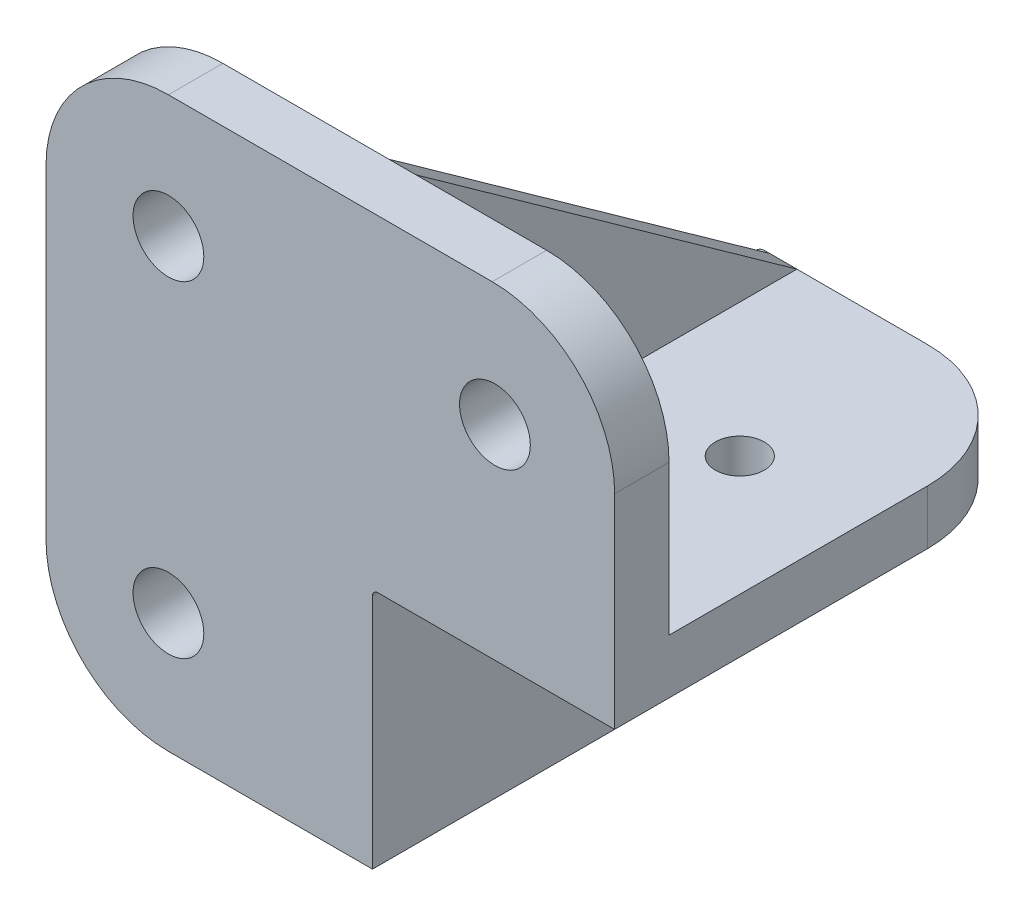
ISO-10303-21;
HEADER;
FILE_DESCRIPTION(('STEP AP214'),'2;1');
FILE_NAME('part.step','',(''),(''),'','','');
FILE_SCHEMA(('AUTOMOTIVE_DESIGN { 1 0 10303 214 1 1 1 1 }'));
ENDSEC;
DATA;
#1=APPLICATION_CONTEXT('core data for automotive mechanical design processes');
#2=APPLICATION_PROTOCOL_DEFINITION('international standard','automotive_design',2000,#1);
#3=PRODUCT_CONTEXT('',#1,'mechanical');
#4=PRODUCT('Part','Part','',(#3));
#5=PRODUCT_RELATED_PRODUCT_CATEGORY('part','',(#4));
#6=PRODUCT_DEFINITION_FORMATION('','',#4);
#7=PRODUCT_DEFINITION_CONTEXT('part definition',#1,'design');
#8=PRODUCT_DEFINITION('design','',#6,#7);
#9=PRODUCT_DEFINITION_SHAPE('','',#8);
#10=(LENGTH_UNIT() NAMED_UNIT(*) SI_UNIT(.MILLI.,.METRE.));
#11=(NAMED_UNIT(*) PLANE_ANGLE_UNIT() SI_UNIT($,.RADIAN.));
#12=(NAMED_UNIT(*) SI_UNIT($,.STERADIAN.) SOLID_ANGLE_UNIT());
#13=UNCERTAINTY_MEASURE_WITH_UNIT(LENGTH_MEASURE(1.E-05),#10,'distance_accuracy_value','');
#14=(GEOMETRIC_REPRESENTATION_CONTEXT(3) GLOBAL_UNCERTAINTY_ASSIGNED_CONTEXT((#13)) GLOBAL_UNIT_ASSIGNED_CONTEXT((#10,
#11,#12)) REPRESENTATION_CONTEXT('',''));
#15=CARTESIAN_POINT('',(0.,0.,0.));
#16=DIRECTION('',(0.,0.,1.));
#17=DIRECTION('',(1.,0.,0.));
#18=AXIS2_PLACEMENT_3D('',#15,#16,#17);
#19=CARTESIAN_POINT('',(44.5000000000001,10.0000000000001,0.));
#20=DIRECTION('',(0.,1.,0.));
#21=DIRECTION('',(0.,0.,1.));
#22=AXIS2_PLACEMENT_3D('',#19,#20,#21);
#23=PLANE('',#22);
#24=DIRECTION('',(0.,0.,-1.));
#25=VECTOR('',#24,1.);
#26=CARTESIAN_POINT('',(-7.85109886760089,10.0000000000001,0.));
#27=LINE('',#26,#25);
#28=CARTESIAN_POINT('',(-7.85109886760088,10.0000000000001,-10.));
#29=VERTEX_POINT('',#28);
#30=CARTESIAN_POINT('',(-7.85109886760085,10.0000000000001,-80.));
#31=VERTEX_POINT('',#30);
#32=EDGE_CURVE('E252',#29,#31,#27,.T.);
#33=ORIENTED_EDGE('',*,*,#32,.F.);
#34=DIRECTION('',(1.,0.,0.));
#35=VECTOR('',#34,1.);
#36=CARTESIAN_POINT('',(44.5000000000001,10.0000000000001,-10.));
#37=LINE('',#36,#35);
#38=CARTESIAN_POINT('',(-6.99999999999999,10.,-10.));
#39=VERTEX_POINT('',#38);
#40=EDGE_CURVE('E267',#29,#39,#37,.T.);
#41=ORIENTED_EDGE('',*,*,#40,.T.);
#42=DIRECTION('',(0.,0.,1.));
#43=VECTOR('',#42,1.);
#44=CARTESIAN_POINT('',(-6.99999999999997,9.99999999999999,-36.5058131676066));
#45=LINE('',#44,#43);
#46=CARTESIAN_POINT('',(-6.99999999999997,10.,-80.));
#47=VERTEX_POINT('',#46);
#48=EDGE_CURVE('E254',#47,#39,#45,.T.);
#49=ORIENTED_EDGE('',*,*,#48,.F.);
#50=DIRECTION('',(1.,0.,0.));
#51=VECTOR('',#50,1.);
#52=CARTESIAN_POINT('',(44.5000000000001,10.0000000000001,-80.));
#53=LINE('',#52,#51);
#54=EDGE_CURVE('E137',#47,#31,#53,.F.);
#55=ORIENTED_EDGE('',*,*,#54,.T.);
#56=EDGE_LOOP('',(#33,#41,#49,#55));
#57=FACE_BOUND('',#56,.T.);
#58=ADVANCED_FACE('F15',(#57),#23,.T.);
#59=CARTESIAN_POINT('',(-10.,7.85109886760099,0.));
#60=DIRECTION('',(-1.,0.,0.));
#61=DIRECTION('',(0.,0.,1.));
#62=AXIS2_PLACEMENT_3D('',#59,#60,#61);
#63=PLANE('',#62);
#64=DIRECTION('',(0.,0.,-1.));
#65=VECTOR('',#64,1.);
#66=CARTESIAN_POINT('',(-9.99999999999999,7.85109886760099,0.));
#67=LINE('',#66,#65);
#68=CARTESIAN_POINT('',(-9.99999999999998,7.85109886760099,-80.));
#69=VERTEX_POINT('',#68);
#70=CARTESIAN_POINT('',(-9.99999999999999,7.85109886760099,-10.));
#71=VERTEX_POINT('',#70);
#72=EDGE_CURVE('E249',#69,#71,#67,.F.);
#73=ORIENTED_EDGE('',*,*,#72,.F.);
#74=DIRECTION('',(0.,1.,0.));
#75=VECTOR('',#74,1.);
#76=CARTESIAN_POINT('',(-10.,7.85109886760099,-80.));
#77=LINE('',#76,#75);
#78=CARTESIAN_POINT('',(-9.99999999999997,6.99999999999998,-80.));
#79=VERTEX_POINT('',#78);
#80=EDGE_CURVE('E130',#69,#79,#77,.F.);
#81=ORIENTED_EDGE('',*,*,#80,.T.);
#82=DIRECTION('',(0.,0.,-1.));
#83=VECTOR('',#82,1.);
#84=CARTESIAN_POINT('',(-9.99999999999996,6.99999999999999,-36.5058131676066));
#85=LINE('',#84,#83);
#86=CARTESIAN_POINT('',(-9.99999999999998,6.99999999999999,-10.));
#87=VERTEX_POINT('',#86);
#88=EDGE_CURVE('E246',#79,#87,#85,.F.);
#89=ORIENTED_EDGE('',*,*,#88,.T.);
#90=DIRECTION('',(0.,1.,0.));
#91=VECTOR('',#90,1.);
#92=CARTESIAN_POINT('',(-10.,7.85109886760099,-10.));
#93=LINE('',#92,#91);
#94=EDGE_CURVE('E265',#87,#71,#93,.T.);
#95=ORIENTED_EDGE('',*,*,#94,.T.);
#96=EDGE_LOOP('',(#73,#81,#89,#95));
#97=FACE_BOUND('',#96,.T.);
#98=ADVANCED_FACE('F663',(#97),#63,.T.);
#99=CARTESIAN_POINT('',(-1.99999999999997,26.5058131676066,-36.5058131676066));
#100=DIRECTION('',(-1.,0.,0.));
#101=DIRECTION('',(0.,0.,1.));
#102=AXIS2_PLACEMENT_3D('',#99,#100,#101);
#103=PLANE('',#102);
#104=DIRECTION('',(0.,0.,1.));
#105=VECTOR('',#104,1.);
#106=CARTESIAN_POINT('',(-1.99999999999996,10.0000000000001,0.));
#107=LINE('',#106,#105);
#108=CARTESIAN_POINT('',(-1.99999999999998,10.0000000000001,-80.));
#109=VERTEX_POINT('',#108);
#110=CARTESIAN_POINT('',(-1.99999999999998,10.0000000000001,-10.));
#111=VERTEX_POINT('',#110);
#112=EDGE_CURVE('E257',#109,#111,#107,.T.);
#113=ORIENTED_EDGE('',*,*,#112,.F.);
#114=DIRECTION('',(0.,0.581238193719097,0.813733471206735));
#115=VECTOR('',#114,1.);
#116=CARTESIAN_POINT('',(-2.,9.99999999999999,-80.));
#117=LINE('',#116,#115);
#118=CARTESIAN_POINT('',(-2.,60.0000000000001,-10.));
#119=VERTEX_POINT('',#118);
#120=EDGE_CURVE('E163',#119,#109,#117,.F.);
#121=ORIENTED_EDGE('',*,*,#120,.F.);
#122=DIRECTION('',(0.,1.,0.));
#123=VECTOR('',#122,1.);
#124=CARTESIAN_POINT('',(-1.99999999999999,11.4356390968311,-10.));
#125=LINE('',#124,#123);
#126=EDGE_CURVE('E326',#111,#119,#125,.T.);
#127=ORIENTED_EDGE('',*,*,#126,.F.);
#128=EDGE_LOOP('',(#113,#121,#127));
#129=FACE_BOUND('',#128,.T.);
#130=ADVANCED_FACE('F376',(#129),#103,.F.);
#131=CARTESIAN_POINT('',(-6.99999999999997,26.5058131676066,-36.5058131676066));
#132=DIRECTION('',(-1.,0.,0.));
#133=DIRECTION('',(0.,0.,1.));
#134=AXIS2_PLACEMENT_3D('',#131,#132,#133);
#135=PLANE('',#134);
#136=DIRECTION('',(0.,1.,0.));
#137=VECTOR('',#136,1.);
#138=CARTESIAN_POINT('',(-7.,11.4356390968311,-10.));
#139=LINE('',#138,#137);
#140=CARTESIAN_POINT('',(-6.99999999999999,60.0000000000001,-10.));
#141=VERTEX_POINT('',#140);
#142=EDGE_CURVE('E322',#141,#39,#139,.F.);
#143=ORIENTED_EDGE('',*,*,#142,.F.);
#144=DIRECTION('',(0.,0.581238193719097,0.813733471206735));
#145=VECTOR('',#144,1.);
#146=CARTESIAN_POINT('',(-6.99999999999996,9.99999999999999,-80.));
#147=LINE('',#146,#145);
#148=EDGE_CURVE('E263',#47,#141,#147,.T.);
#149=ORIENTED_EDGE('',*,*,#148,.F.);
#150=ORIENTED_EDGE('',*,*,#48,.T.);
#151=EDGE_LOOP('',(#143,#149,#150));
#152=FACE_BOUND('',#151,.T.);
#153=ADVANCED_FACE('F346',(#152),#135,.T.);
#154=CARTESIAN_POINT('',(-7.85109886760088,7.85109886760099,0.));
#155=DIRECTION('',(0.,0.,-1.));
#156=DIRECTION('',(-1.,0.,0.));
#157=AXIS2_PLACEMENT_3D('',#154,#155,#156);
#158=CYLINDRICAL_SURFACE('',#157,2.14890113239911);
#159=CARTESIAN_POINT('',(-7.85109886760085,7.85109886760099,-80.));
#160=DIRECTION('',(0.,0.,-1.));
#161=DIRECTION('',(-1.,0.,0.));
#162=AXIS2_PLACEMENT_3D('',#159,#160,#161);
#163=CIRCLE('',#162,2.14890113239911);
#164=EDGE_CURVE('E18',#69,#31,#163,.T.);
#165=ORIENTED_EDGE('',*,*,#164,.F.);
#166=ORIENTED_EDGE('',*,*,#72,.T.);
#167=CARTESIAN_POINT('',(-7.85109886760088,7.85109886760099,-10.));
#168=DIRECTION('',(0.,0.,-1.));
#169=DIRECTION('',(-1.,0.,0.));
#170=AXIS2_PLACEMENT_3D('',#167,#168,#169);
#171=CIRCLE('',#170,2.14890113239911);
#172=EDGE_CURVE('E222',#29,#71,#171,.F.);
#173=ORIENTED_EDGE('',*,*,#172,.F.);
#174=ORIENTED_EDGE('',*,*,#32,.T.);
#175=EDGE_LOOP('',(#165,#166,#173,#174));
#176=FACE_BOUND('',#175,.T.);
#177=ADVANCED_FACE('F340',(#176),#158,.T.);
#178=CARTESIAN_POINT('',(-26.5058131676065,6.99999999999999,-36.5058131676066));
#179=DIRECTION('',(0.,-1.,0.));
#180=DIRECTION('',(0.,0.,-1.));
#181=AXIS2_PLACEMENT_3D('',#178,#179,#180);
#182=PLANE('',#181);
#183=ORIENTED_EDGE('',*,*,#88,.F.);
#184=DIRECTION('',(-0.581238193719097,0.,0.813733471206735));
#185=VECTOR('',#184,1.);
#186=CARTESIAN_POINT('',(-9.99999999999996,6.99999999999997,-80.));
#187=LINE('',#186,#185);
#188=CARTESIAN_POINT('',(-59.9999999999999,6.99999999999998,-10.));
#189=VERTEX_POINT('',#188);
#190=EDGE_CURVE('E190',#189,#79,#187,.F.);
#191=ORIENTED_EDGE('',*,*,#190,.F.);
#192=DIRECTION('',(-1.,0.,0.));
#193=VECTOR('',#192,1.);
#194=CARTESIAN_POINT('',(-11.4356390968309,6.99999999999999,-10.));
#195=LINE('',#194,#193);
#196=EDGE_CURVE('E175',#87,#189,#195,.T.);
#197=ORIENTED_EDGE('',*,*,#196,.F.);
#198=EDGE_LOOP('',(#183,#191,#197));
#199=FACE_BOUND('',#198,.T.);
#200=ADVANCED_FACE('F637',(#199),#182,.F.);
#201=CARTESIAN_POINT('',(-26.5058131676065,1.99999999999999,-36.5058131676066));
#202=DIRECTION('',(0.,-1.,0.));
#203=DIRECTION('',(0.,0.,-1.));
#204=AXIS2_PLACEMENT_3D('',#201,#202,#203);
#205=PLANE('',#204);
#206=DIRECTION('',(-1.,0.,0.));
#207=VECTOR('',#206,1.);
#208=CARTESIAN_POINT('',(-11.4356390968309,1.99999999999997,-10.));
#209=LINE('',#208,#207);
#210=CARTESIAN_POINT('',(-59.9999999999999,1.99999999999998,-10.));
#211=VERTEX_POINT('',#210);
#212=CARTESIAN_POINT('',(-9.99999999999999,1.99999999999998,-10.));
#213=VERTEX_POINT('',#212);
#214=EDGE_CURVE('E203',#211,#213,#209,.F.);
#215=ORIENTED_EDGE('',*,*,#214,.F.);
#216=DIRECTION('',(-0.581238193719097,0.,0.813733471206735));
#217=VECTOR('',#216,1.);
#218=CARTESIAN_POINT('',(-9.99999999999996,1.99999999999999,-80.));
#219=LINE('',#218,#217);
#220=CARTESIAN_POINT('',(-9.99999999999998,1.99999999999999,-80.));
#221=VERTEX_POINT('',#220);
#222=EDGE_CURVE('E181',#221,#211,#219,.T.);
#223=ORIENTED_EDGE('',*,*,#222,.F.);
#224=DIRECTION('',(0.,0.,1.));
#225=VECTOR('',#224,1.);
#226=CARTESIAN_POINT('',(-10.,1.99999999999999,0.));
#227=LINE('',#226,#225);
#228=EDGE_CURVE('E144',#213,#221,#227,.F.);
#229=ORIENTED_EDGE('',*,*,#228,.F.);
#230=EDGE_LOOP('',(#215,#223,#229));
#231=FACE_BOUND('',#230,.T.);
#232=ADVANCED_FACE('F204',(#231),#205,.T.);
#233=CARTESIAN_POINT('',(22.5,4.99999999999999,-45.));
#234=DIRECTION('',(0.,1.,0.));
#235=DIRECTION('',(-1.,0.,0.));
#236=AXIS2_PLACEMENT_3D('',#233,#234,#235);
#237=CYLINDRICAL_SURFACE('',#236,4.5);
#238=CARTESIAN_POINT('',(22.5,0.,-45.));
#239=DIRECTION('',(0.,1.,0.));
#240=DIRECTION('',(-1.,0.,0.));
#241=AXIS2_PLACEMENT_3D('',#238,#239,#240);
#242=CIRCLE('',#241,4.5);
#243=CARTESIAN_POINT('',(18.,0.,-45.));
#244=VERTEX_POINT('',#243);
#245=EDGE_CURVE('E314',#244,#244,#242,.T.);
#246=ORIENTED_EDGE('',*,*,#245,.F.);
#247=EDGE_LOOP('',(#246));
#248=FACE_BOUND('',#247,.T.);
#249=CARTESIAN_POINT('',(22.5,10.0000000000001,-45.));
#250=DIRECTION('',(0.,1.,0.));
#251=DIRECTION('',(-1.,0.,0.));
#252=AXIS2_PLACEMENT_3D('',#249,#250,#251);
#253=CIRCLE('',#252,4.5);
#254=CARTESIAN_POINT('',(18.,10.0000000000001,-45.));
#255=VERTEX_POINT('',#254);
#256=EDGE_CURVE('E323',#255,#255,#253,.F.);
#257=ORIENTED_EDGE('',*,*,#256,.F.);
#258=EDGE_LOOP('',(#257));
#259=FACE_BOUND('',#258,.T.);
#260=ADVANCED_FACE('F623',(#248,#259),#237,.F.);
#261=CARTESIAN_POINT('',(8.26219036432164,-8.26219036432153,-80.));
#262=DIRECTION('',(0.,0.,-1.));
#263=DIRECTION('',(-1.,0.,0.));
#264=AXIS2_PLACEMENT_3D('',#261,#262,#263);
#265=PLANE('',#264);
#266=DIRECTION('',(1.,0.,0.));
#267=VECTOR('',#266,1.);
#268=CARTESIAN_POINT('',(-1.99999999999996,9.99999999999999,-80.));
#269=LINE('',#268,#267);
#270=EDGE_CURVE('E244',#109,#47,#269,.F.);
#271=ORIENTED_EDGE('',*,*,#270,.F.);
#272=DIRECTION('',(1.,0.,0.));
#273=VECTOR('',#272,1.);
#274=CARTESIAN_POINT('',(44.5000000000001,10.0000000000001,-80.));
#275=LINE('',#274,#273);
#276=CARTESIAN_POINT('',(22.,10.0000000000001,-80.));
#277=VERTEX_POINT('',#276);
#278=EDGE_CURVE('E243',#277,#109,#275,.F.);
#279=ORIENTED_EDGE('',*,*,#278,.F.);
#280=DIRECTION('',(0.,-1.,0.));
#281=VECTOR('',#280,1.);
#282=CARTESIAN_POINT('',(22.,12.5,-80.));
#283=LINE('',#282,#281);
#284=CARTESIAN_POINT('',(22.,0.,-80.));
#285=VERTEX_POINT('',#284);
#286=EDGE_CURVE('E241',#285,#277,#283,.F.);
#287=ORIENTED_EDGE('',*,*,#286,.F.);
#288=DIRECTION('',(1.,0.,0.));
#289=VECTOR('',#288,1.);
#290=CARTESIAN_POINT('',(1.,0.,-80.));
#291=LINE('',#290,#289);
#292=CARTESIAN_POINT('',(1.00000000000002,0.,-80.));
#293=VERTEX_POINT('',#292);
#294=EDGE_CURVE('E317',#293,#285,#291,.T.);
#295=ORIENTED_EDGE('',*,*,#294,.F.);
#296=CARTESIAN_POINT('',(1.00000000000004,-1.00000000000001,-80.));
#297=DIRECTION('',(0.,0.,-1.));
#298=DIRECTION('',(-1.,0.,0.));
#299=AXIS2_PLACEMENT_3D('',#296,#297,#298);
#300=CIRCLE('',#299,1.);
#301=CARTESIAN_POINT('',(0.,-1.00000000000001,-80.));
#302=VERTEX_POINT('',#301);
#303=EDGE_CURVE('E332',#293,#302,#300,.F.);
#304=ORIENTED_EDGE('',*,*,#303,.T.);
#305=DIRECTION('',(0.,1.,0.));
#306=VECTOR('',#305,1.);
#307=CARTESIAN_POINT('',(0.,-44.5000000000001,-80.));
#308=LINE('',#307,#306);
#309=CARTESIAN_POINT('',(0.,-22.,-80.));
#310=VERTEX_POINT('',#309);
#311=EDGE_CURVE('E313',#310,#302,#308,.T.);
#312=ORIENTED_EDGE('',*,*,#311,.F.);
#313=DIRECTION('',(-1.,0.,0.));
#314=VECTOR('',#313,1.);
#315=CARTESIAN_POINT('',(2.50000000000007,-22.,-80.));
#316=LINE('',#315,#314);
#317=CARTESIAN_POINT('',(-9.99999999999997,-22.,-80.));
#318=VERTEX_POINT('',#317);
#319=EDGE_CURVE('E238',#318,#310,#316,.F.);
#320=ORIENTED_EDGE('',*,*,#319,.F.);
#321=DIRECTION('',(0.,1.,0.));
#322=VECTOR('',#321,1.);
#323=CARTESIAN_POINT('',(-10.,7.85109886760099,-80.));
#324=LINE('',#323,#322);
#325=EDGE_CURVE('E228',#221,#318,#324,.F.);
#326=ORIENTED_EDGE('',*,*,#325,.F.);
#327=DIRECTION('',(0.,1.,0.));
#328=VECTOR('',#327,1.);
#329=CARTESIAN_POINT('',(-9.99999999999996,6.99999999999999,-80.));
#330=LINE('',#329,#328);
#331=EDGE_CURVE('E186',#79,#221,#330,.F.);
#332=ORIENTED_EDGE('',*,*,#331,.F.);
#333=ORIENTED_EDGE('',*,*,#80,.F.);
#334=ORIENTED_EDGE('',*,*,#164,.T.);
#335=ORIENTED_EDGE('',*,*,#54,.F.);
#336=EDGE_LOOP('',(#271,#279,#287,#295,#304,#312,#320,#326,#332,#333,#334,#335));
#337=FACE_BOUND('',#336,.T.);
#338=ADVANCED_FACE('F338',(#337),#265,.T.);
#339=CARTESIAN_POINT('',(1.,-1.,0.));
#340=DIRECTION('',(0.,0.,-1.));
#341=DIRECTION('',(-1.,0.,0.));
#342=AXIS2_PLACEMENT_3D('',#339,#340,#341);
#343=CYLINDRICAL_SURFACE('',#342,1.);
#344=CARTESIAN_POINT('',(1.,-1.,0.));
#345=DIRECTION('',(0.,0.,-1.));
#346=DIRECTION('',(-1.,0.,0.));
#347=AXIS2_PLACEMENT_3D('',#344,#345,#346);
#348=CIRCLE('',#347,1.);
#349=CARTESIAN_POINT('',(0.,-1.00000000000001,0.));
#350=VERTEX_POINT('',#349);
#351=CARTESIAN_POINT('',(1.,0.,0.));
#352=VERTEX_POINT('',#351);
#353=EDGE_CURVE('E240',#350,#352,#348,.T.);
#354=ORIENTED_EDGE('',*,*,#353,.F.);
#355=DIRECTION('',(0.,0.,-1.));
#356=VECTOR('',#355,1.);
#357=CARTESIAN_POINT('',(0.,-1.00000000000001,0.));
#358=LINE('',#357,#356);
#359=EDGE_CURVE('E309',#302,#350,#358,.F.);
#360=ORIENTED_EDGE('',*,*,#359,.F.);
#361=ORIENTED_EDGE('',*,*,#303,.F.);
#362=DIRECTION('',(0.,0.,-1.));
#363=VECTOR('',#362,1.);
#364=CARTESIAN_POINT('',(1.,0.,0.));
#365=LINE('',#364,#363);
#366=EDGE_CURVE('E319',#352,#293,#365,.T.);
#367=ORIENTED_EDGE('',*,*,#366,.F.);
#368=EDGE_LOOP('',(#354,#360,#361,#367));
#369=FACE_BOUND('',#368,.T.);
#370=ADVANCED_FACE('F608',(#369),#343,.F.);
#371=CARTESIAN_POINT('',(-4.99999999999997,-22.5,-45.));
#372=DIRECTION('',(-1.,0.,0.));
#373=DIRECTION('',(0.,0.,1.));
#374=AXIS2_PLACEMENT_3D('',#371,#372,#373);
#375=CYLINDRICAL_SURFACE('',#374,4.5);
#376=CARTESIAN_POINT('',(-9.99999999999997,-22.5,-45.));
#377=DIRECTION('',(-1.,0.,0.));
#378=DIRECTION('',(0.,0.,1.));
#379=AXIS2_PLACEMENT_3D('',#376,#377,#378);
#380=CIRCLE('',#379,4.5);
#381=CARTESIAN_POINT('',(-9.99999999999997,-22.5,-40.5));
#382=VERTEX_POINT('',#381);
#383=EDGE_CURVE('E191',#382,#382,#380,.F.);
#384=ORIENTED_EDGE('',*,*,#383,.F.);
#385=EDGE_LOOP('',(#384));
#386=FACE_BOUND('',#385,.T.);
#387=CARTESIAN_POINT('',(0.,-22.5,-45.));
#388=DIRECTION('',(-1.,0.,0.));
#389=DIRECTION('',(0.,0.,1.));
#390=AXIS2_PLACEMENT_3D('',#387,#388,#389);
#391=CIRCLE('',#390,4.5);
#392=CARTESIAN_POINT('',(0.,-22.5,-40.5));
#393=VERTEX_POINT('',#392);
#394=EDGE_CURVE('E233',#393,#393,#391,.T.);
#395=ORIENTED_EDGE('',*,*,#394,.F.);
#396=EDGE_LOOP('',(#395));
#397=FACE_BOUND('',#396,.T.);
#398=ADVANCED_FACE('F600',(#386,#397),#375,.F.);
#399=CARTESIAN_POINT('',(2.50000000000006,-22.,-57.5));
#400=DIRECTION('',(-1.,0.,0.));
#401=DIRECTION('',(0.,0.,1.));
#402=AXIS2_PLACEMENT_3D('',#399,#400,#401);
#403=CYLINDRICAL_SURFACE('',#402,22.5);
#404=CARTESIAN_POINT('',(0.,-22.,-57.5));
#405=DIRECTION('',(-1.,0.,0.));
#406=DIRECTION('',(0.,0.,1.));
#407=AXIS2_PLACEMENT_3D('',#404,#405,#406);
#408=CIRCLE('',#407,22.5);
#409=CARTESIAN_POINT('',(0.,-44.5000000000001,-57.5));
#410=VERTEX_POINT('',#409);
#411=EDGE_CURVE('E310',#410,#310,#408,.F.);
#412=ORIENTED_EDGE('',*,*,#411,.F.);
#413=DIRECTION('',(1.,0.,0.));
#414=VECTOR('',#413,1.);
#415=CARTESIAN_POINT('',(-37.4999999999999,-44.5000000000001,-57.5));
#416=LINE('',#415,#414);
#417=CARTESIAN_POINT('',(-9.99999999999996,-44.5000000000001,-57.5));
#418=VERTEX_POINT('',#417);
#419=EDGE_CURVE('E231',#418,#410,#416,.T.);
#420=ORIENTED_EDGE('',*,*,#419,.F.);
#421=CARTESIAN_POINT('',(-9.99999999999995,-22.,-57.5));
#422=DIRECTION('',(-1.,0.,0.));
#423=DIRECTION('',(0.,0.,1.));
#424=AXIS2_PLACEMENT_3D('',#421,#422,#423);
#425=CIRCLE('',#424,22.5);
#426=EDGE_CURVE('E230',#318,#418,#425,.T.);
#427=ORIENTED_EDGE('',*,*,#426,.F.);
#428=ORIENTED_EDGE('',*,*,#319,.T.);
#429=EDGE_LOOP('',(#412,#420,#427,#428));
#430=FACE_BOUND('',#429,.T.);
#431=ADVANCED_FACE('F592',(#430),#403,.T.);
#432=CARTESIAN_POINT('',(-10.,7.85109886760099,0.));
#433=DIRECTION('',(-1.,0.,0.));
#434=DIRECTION('',(0.,0.,1.));
#435=AXIS2_PLACEMENT_3D('',#432,#433,#434);
#436=PLANE('',#435);
#437=ORIENTED_EDGE('',*,*,#383,.T.);
#438=EDGE_LOOP('',(#437));
#439=FACE_BOUND('',#438,.T.);
#440=ORIENTED_EDGE('',*,*,#325,.T.);
#441=ORIENTED_EDGE('',*,*,#426,.T.);
#442=DIRECTION('',(0.,0.,-1.));
#443=VECTOR('',#442,1.);
#444=CARTESIAN_POINT('',(-9.99999999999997,-44.5000000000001,0.));
#445=LINE('',#444,#443);
#446=CARTESIAN_POINT('',(-9.99999999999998,-44.5000000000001,-10.));
#447=VERTEX_POINT('',#446);
#448=EDGE_CURVE('E226',#447,#418,#445,.T.);
#449=ORIENTED_EDGE('',*,*,#448,.F.);
#450=DIRECTION('',(0.,1.,0.));
#451=VECTOR('',#450,1.);
#452=CARTESIAN_POINT('',(-9.99999999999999,11.4356390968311,-10.));
#453=LINE('',#452,#451);
#454=EDGE_CURVE('E207',#213,#447,#453,.F.);
#455=ORIENTED_EDGE('',*,*,#454,.F.);
#456=ORIENTED_EDGE('',*,*,#228,.T.);
#457=EDGE_LOOP('',(#440,#441,#449,#455,#456));
#458=FACE_BOUND('',#457,.T.);
#459=ADVANCED_FACE('F585',(#439,#458),#436,.T.);
#460=CARTESIAN_POINT('',(-9.99999999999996,6.99999999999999,-80.));
#461=DIRECTION('',(-0.813733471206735,0.,-0.581238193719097));
#462=DIRECTION('',(-0.581238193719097,0.,0.813733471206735));
#463=AXIS2_PLACEMENT_3D('',#460,#461,#462);
#464=PLANE('',#463);
#465=ORIENTED_EDGE('',*,*,#190,.T.);
#466=ORIENTED_EDGE('',*,*,#331,.T.);
#467=ORIENTED_EDGE('',*,*,#222,.T.);
#468=DIRECTION('',(0.,1.,0.));
#469=VECTOR('',#468,1.);
#470=CARTESIAN_POINT('',(-59.9999999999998,37.5,-10.));
#471=LINE('',#470,#469);
#472=EDGE_CURVE('E185',#189,#211,#471,.F.);
#473=ORIENTED_EDGE('',*,*,#472,.F.);
#474=EDGE_LOOP('',(#465,#466,#467,#473));
#475=FACE_BOUND('',#474,.T.);
#476=ADVANCED_FACE('F184',(#475),#464,.T.);
#477=CARTESIAN_POINT('',(-1.99999999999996,9.99999999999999,-80.));
#478=DIRECTION('',(0.,0.813733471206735,-0.581238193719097));
#479=DIRECTION('',(0.,0.581238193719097,0.813733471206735));
#480=AXIS2_PLACEMENT_3D('',#477,#478,#479);
#481=PLANE('',#480);
#482=ORIENTED_EDGE('',*,*,#120,.T.);
#483=ORIENTED_EDGE('',*,*,#270,.T.);
#484=ORIENTED_EDGE('',*,*,#148,.T.);
#485=DIRECTION('',(1.,0.,0.));
#486=VECTOR('',#485,1.);
#487=CARTESIAN_POINT('',(22.0000000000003,60.0000000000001,-10.));
#488=LINE('',#487,#486);
#489=EDGE_CURVE('E358',#119,#141,#488,.F.);
#490=ORIENTED_EDGE('',*,*,#489,.F.);
#491=EDGE_LOOP('',(#482,#483,#484,#490));
#492=FACE_BOUND('',#491,.T.);
#493=ADVANCED_FACE('F378',(#492),#481,.T.);
#494=CARTESIAN_POINT('',(22.,12.5,-57.5));
#495=DIRECTION('',(0.,-1.,0.));
#496=DIRECTION('',(1.,0.,0.));
#497=AXIS2_PLACEMENT_3D('',#494,#495,#496);
#498=CYLINDRICAL_SURFACE('',#497,22.5);
#499=CARTESIAN_POINT('',(22.,10.0000000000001,-57.5));
#500=DIRECTION('',(0.,-1.,0.));
#501=DIRECTION('',(1.,0.,0.));
#502=AXIS2_PLACEMENT_3D('',#499,#500,#501);
#503=CIRCLE('',#502,22.5);
#504=CARTESIAN_POINT('',(44.5000000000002,10.0000000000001,-57.5));
#505=VERTEX_POINT('',#504);
#506=EDGE_CURVE('E260',#505,#277,#503,.F.);
#507=ORIENTED_EDGE('',*,*,#506,.F.);
#508=DIRECTION('',(0.,1.,0.));
#509=VECTOR('',#508,1.);
#510=CARTESIAN_POINT('',(44.5000000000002,0.,-57.5));
#511=LINE('',#510,#509);
#512=CARTESIAN_POINT('',(44.5000000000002,0.,-57.5));
#513=VERTEX_POINT('',#512);
#514=EDGE_CURVE('E387',#513,#505,#511,.T.);
#515=ORIENTED_EDGE('',*,*,#514,.F.);
#516=CARTESIAN_POINT('',(22.,0.,-57.5));
#517=DIRECTION('',(0.,-1.,0.));
#518=DIRECTION('',(1.,0.,0.));
#519=AXIS2_PLACEMENT_3D('',#516,#517,#518);
#520=CIRCLE('',#519,22.5);
#521=EDGE_CURVE('E237',#285,#513,#520,.T.);
#522=ORIENTED_EDGE('',*,*,#521,.F.);
#523=ORIENTED_EDGE('',*,*,#286,.T.);
#524=EDGE_LOOP('',(#507,#515,#522,#523));
#525=FACE_BOUND('',#524,.T.);
#526=ADVANCED_FACE('F430',(#525),#498,.T.);
#527=CARTESIAN_POINT('',(44.5000000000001,10.0000000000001,0.));
#528=DIRECTION('',(0.,1.,0.));
#529=DIRECTION('',(0.,0.,1.));
#530=AXIS2_PLACEMENT_3D('',#527,#528,#529);
#531=PLANE('',#530);
#532=ORIENTED_EDGE('',*,*,#256,.T.);
#533=EDGE_LOOP('',(#532));
#534=FACE_BOUND('',#533,.T.);
#535=DIRECTION('',(0.,0.,-1.));
#536=VECTOR('',#535,1.);
#537=CARTESIAN_POINT('',(44.5000000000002,10.0000000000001,0.));
#538=LINE('',#537,#536);
#539=CARTESIAN_POINT('',(44.5000000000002,10.0000000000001,-9.99999999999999));
#540=VERTEX_POINT('',#539);
#541=EDGE_CURVE('E384',#505,#540,#538,.F.);
#542=ORIENTED_EDGE('',*,*,#541,.F.);
#543=ORIENTED_EDGE('',*,*,#506,.T.);
#544=ORIENTED_EDGE('',*,*,#278,.T.);
#545=ORIENTED_EDGE('',*,*,#112,.T.);
#546=DIRECTION('',(-1.,0.,0.));
#547=VECTOR('',#546,1.);
#548=CARTESIAN_POINT('',(-11.4356390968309,10.0000000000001,-10.));
#549=LINE('',#548,#547);
#550=EDGE_CURVE('E351',#540,#111,#549,.T.);
#551=ORIENTED_EDGE('',*,*,#550,.F.);
#552=EDGE_LOOP('',(#542,#543,#544,#545,#551));
#553=FACE_BOUND('',#552,.T.);
#554=ADVANCED_FACE('F428',(#534,#553),#531,.T.);
#555=CARTESIAN_POINT('',(-11.4356390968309,11.4356390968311,-10.));
#556=DIRECTION('',(0.,0.,-1.));
#557=DIRECTION('',(-1.,0.,0.));
#558=AXIS2_PLACEMENT_3D('',#555,#556,#557);
#559=PLANE('',#558);
#560=CARTESIAN_POINT('',(22.5,37.5,-10.));
#561=DIRECTION('',(0.,0.,1.));
#562=DIRECTION('',(1.,0.,0.));
#563=AXIS2_PLACEMENT_3D('',#560,#561,#562);
#564=CIRCLE('',#563,6.5);
#565=CARTESIAN_POINT('',(29.,37.5,-9.99999999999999));
#566=VERTEX_POINT('',#565);
#567=EDGE_CURVE('E295',#566,#566,#564,.T.);
#568=ORIENTED_EDGE('',*,*,#567,.T.);
#569=EDGE_LOOP('',(#568));
#570=FACE_BOUND('',#569,.T.);
#571=DIRECTION('',(0.,1.,0.));
#572=VECTOR('',#571,1.);
#573=CARTESIAN_POINT('',(44.5000000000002,0.,-9.99999999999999));
#574=LINE('',#573,#572);
#575=CARTESIAN_POINT('',(44.5000000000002,37.5000000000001,-9.99999999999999));
#576=VERTEX_POINT('',#575);
#577=EDGE_CURVE('E386',#540,#576,#574,.T.);
#578=ORIENTED_EDGE('',*,*,#577,.F.);
#579=ORIENTED_EDGE('',*,*,#550,.T.);
#580=ORIENTED_EDGE('',*,*,#126,.T.);
#581=DIRECTION('',(1.,0.,0.));
#582=VECTOR('',#581,1.);
#583=CARTESIAN_POINT('',(22.0000000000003,60.0000000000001,-10.));
#584=LINE('',#583,#582);
#585=CARTESIAN_POINT('',(22.0000000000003,60.0000000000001,-10.));
#586=VERTEX_POINT('',#585);
#587=EDGE_CURVE('E361',#586,#119,#584,.F.);
#588=ORIENTED_EDGE('',*,*,#587,.F.);
#589=CARTESIAN_POINT('',(22.0000000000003,37.5000000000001,-10.));
#590=DIRECTION('',(0.,0.,-1.));
#591=DIRECTION('',(-1.,0.,0.));
#592=AXIS2_PLACEMENT_3D('',#589,#590,#591);
#593=CIRCLE('',#592,22.5);
#594=EDGE_CURVE('E299',#576,#586,#593,.F.);
#595=ORIENTED_EDGE('',*,*,#594,.F.);
#596=EDGE_LOOP('',(#578,#579,#580,#588,#595));
#597=FACE_BOUND('',#596,.T.);
#598=ADVANCED_FACE('F368',(#570,#597),#559,.T.);
#599=CARTESIAN_POINT('',(-11.4356390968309,11.4356390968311,-10.));
#600=DIRECTION('',(0.,0.,-1.));
#601=DIRECTION('',(-1.,0.,0.));
#602=AXIS2_PLACEMENT_3D('',#599,#600,#601);
#603=PLANE('',#602);
#604=CARTESIAN_POINT('',(-37.5,37.5,-10.));
#605=DIRECTION('',(0.,0.,1.));
#606=DIRECTION('',(1.,0.,0.));
#607=AXIS2_PLACEMENT_3D('',#604,#605,#606);
#608=CIRCLE('',#607,6.5);
#609=CARTESIAN_POINT('',(-31.,37.5,-10.));
#610=VERTEX_POINT('',#609);
#611=EDGE_CURVE('E292',#610,#610,#608,.T.);
#612=ORIENTED_EDGE('',*,*,#611,.T.);
#613=EDGE_LOOP('',(#612));
#614=FACE_BOUND('',#613,.T.);
#615=CARTESIAN_POINT('',(-37.4999999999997,37.5,-10.));
#616=DIRECTION('',(0.,0.,-1.));
#617=DIRECTION('',(-1.,0.,0.));
#618=AXIS2_PLACEMENT_3D('',#615,#616,#617);
#619=CIRCLE('',#618,22.5000000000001);
#620=CARTESIAN_POINT('',(-37.4999999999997,60.0000000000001,-10.));
#621=VERTEX_POINT('',#620);
#622=CARTESIAN_POINT('',(-59.9999999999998,37.5,-10.));
#623=VERTEX_POINT('',#622);
#624=EDGE_CURVE('E215',#621,#623,#619,.F.);
#625=ORIENTED_EDGE('',*,*,#624,.F.);
#626=DIRECTION('',(1.,0.,0.));
#627=VECTOR('',#626,1.);
#628=CARTESIAN_POINT('',(22.0000000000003,60.0000000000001,-10.));
#629=LINE('',#628,#627);
#630=EDGE_CURVE('E350',#141,#621,#629,.F.);
#631=ORIENTED_EDGE('',*,*,#630,.F.);
#632=ORIENTED_EDGE('',*,*,#142,.T.);
#633=ORIENTED_EDGE('',*,*,#40,.F.);
#634=ORIENTED_EDGE('',*,*,#172,.T.);
#635=ORIENTED_EDGE('',*,*,#94,.F.);
#636=ORIENTED_EDGE('',*,*,#196,.T.);
#637=DIRECTION('',(0.,1.,0.));
#638=VECTOR('',#637,1.);
#639=CARTESIAN_POINT('',(-59.9999999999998,37.5,-10.));
#640=LINE('',#639,#638);
#641=EDGE_CURVE('E200',#623,#189,#640,.F.);
#642=ORIENTED_EDGE('',*,*,#641,.F.);
#643=EDGE_LOOP('',(#625,#631,#632,#633,#634,#635,#636,#642));
#644=FACE_BOUND('',#643,.T.);
#645=ADVANCED_FACE('F349',(#614,#644),#603,.T.);
#646=CARTESIAN_POINT('',(-11.4356390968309,11.4356390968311,-10.));
#647=DIRECTION('',(0.,0.,-1.));
#648=DIRECTION('',(-1.,0.,0.));
#649=AXIS2_PLACEMENT_3D('',#646,#647,#648);
#650=PLANE('',#649);
#651=CARTESIAN_POINT('',(-37.5,-22.5,-10.));
#652=DIRECTION('',(0.,0.,1.));
#653=DIRECTION('',(1.,0.,0.));
#654=AXIS2_PLACEMENT_3D('',#651,#652,#653);
#655=CIRCLE('',#654,6.5);
#656=CARTESIAN_POINT('',(-31.,-22.5,-10.));
#657=VERTEX_POINT('',#656);
#658=EDGE_CURVE('E288',#657,#657,#655,.T.);
#659=ORIENTED_EDGE('',*,*,#658,.T.);
#660=EDGE_LOOP('',(#659));
#661=FACE_BOUND('',#660,.T.);
#662=CARTESIAN_POINT('',(-37.4999999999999,-22.0000000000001,-10.));
#663=DIRECTION('',(0.,0.,-1.));
#664=DIRECTION('',(-1.,0.,0.));
#665=AXIS2_PLACEMENT_3D('',#662,#663,#664);
#666=CIRCLE('',#665,22.5);
#667=CARTESIAN_POINT('',(-59.9999999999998,-22.0000000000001,-10.));
#668=VERTEX_POINT('',#667);
#669=CARTESIAN_POINT('',(-37.4999999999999,-44.5000000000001,-10.));
#670=VERTEX_POINT('',#669);
#671=EDGE_CURVE('E211',#668,#670,#666,.F.);
#672=ORIENTED_EDGE('',*,*,#671,.F.);
#673=DIRECTION('',(0.,1.,0.));
#674=VECTOR('',#673,1.);
#675=CARTESIAN_POINT('',(-59.9999999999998,37.5,-10.));
#676=LINE('',#675,#674);
#677=EDGE_CURVE('E197',#211,#668,#676,.F.);
#678=ORIENTED_EDGE('',*,*,#677,.F.);
#679=ORIENTED_EDGE('',*,*,#214,.T.);
#680=ORIENTED_EDGE('',*,*,#454,.T.);
#681=DIRECTION('',(1.,0.,0.));
#682=VECTOR('',#681,1.);
#683=CARTESIAN_POINT('',(-37.4999999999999,-44.5000000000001,-10.));
#684=LINE('',#683,#682);
#685=EDGE_CURVE('E223',#670,#447,#684,.T.);
#686=ORIENTED_EDGE('',*,*,#685,.F.);
#687=EDGE_LOOP('',(#672,#678,#679,#680,#686));
#688=FACE_BOUND('',#687,.T.);
#689=ADVANCED_FACE('F209',(#661,#688),#650,.T.);
#690=CARTESIAN_POINT('',(1.,0.,0.));
#691=DIRECTION('',(0.,-1.,0.));
#692=DIRECTION('',(0.,0.,-1.));
#693=AXIS2_PLACEMENT_3D('',#690,#691,#692);
#694=PLANE('',#693);
#695=ORIENTED_EDGE('',*,*,#245,.T.);
#696=EDGE_LOOP('',(#695));
#697=FACE_BOUND('',#696,.T.);
#698=ORIENTED_EDGE('',*,*,#366,.T.);
#699=ORIENTED_EDGE('',*,*,#294,.T.);
#700=ORIENTED_EDGE('',*,*,#521,.T.);
#701=DIRECTION('',(0.,0.,-1.));
#702=VECTOR('',#701,1.);
#703=CARTESIAN_POINT('',(44.5000000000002,0.,0.));
#704=LINE('',#703,#702);
#705=CARTESIAN_POINT('',(44.5000000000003,0.,0.));
#706=VERTEX_POINT('',#705);
#707=EDGE_CURVE('E298',#706,#513,#704,.T.);
#708=ORIENTED_EDGE('',*,*,#707,.F.);
#709=DIRECTION('',(-1.,0.,0.));
#710=VECTOR('',#709,1.);
#711=CARTESIAN_POINT('',(-11.4356390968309,0.,0.));
#712=LINE('',#711,#710);
#713=EDGE_CURVE('E291',#706,#352,#712,.T.);
#714=ORIENTED_EDGE('',*,*,#713,.T.);
#715=EDGE_LOOP('',(#698,#699,#700,#708,#714));
#716=FACE_BOUND('',#715,.T.);
#717=ADVANCED_FACE('F485',(#697,#716),#694,.T.);
#718=CARTESIAN_POINT('',(0.,-44.5000000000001,0.));
#719=DIRECTION('',(1.,0.,0.));
#720=DIRECTION('',(0.,0.,-1.));
#721=AXIS2_PLACEMENT_3D('',#718,#719,#720);
#722=PLANE('',#721);
#723=ORIENTED_EDGE('',*,*,#394,.T.);
#724=EDGE_LOOP('',(#723));
#725=FACE_BOUND('',#724,.T.);
#726=DIRECTION('',(0.,1.,0.));
#727=VECTOR('',#726,1.);
#728=CARTESIAN_POINT('',(0.,11.4356390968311,0.));
#729=LINE('',#728,#727);
#730=CARTESIAN_POINT('',(0.,-44.5000000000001,0.));
#731=VERTEX_POINT('',#730);
#732=EDGE_CURVE('E408',#350,#731,#729,.F.);
#733=ORIENTED_EDGE('',*,*,#732,.T.);
#734=DIRECTION('',(0.,0.,-1.));
#735=VECTOR('',#734,1.);
#736=CARTESIAN_POINT('',(0.,-44.5000000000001,0.));
#737=LINE('',#736,#735);
#738=EDGE_CURVE('E227',#410,#731,#737,.F.);
#739=ORIENTED_EDGE('',*,*,#738,.F.);
#740=ORIENTED_EDGE('',*,*,#411,.T.);
#741=ORIENTED_EDGE('',*,*,#311,.T.);
#742=ORIENTED_EDGE('',*,*,#359,.T.);
#743=EDGE_LOOP('',(#733,#739,#740,#741,#742));
#744=FACE_BOUND('',#743,.T.);
#745=ADVANCED_FACE('F481',(#725,#744),#722,.T.);
#746=CARTESIAN_POINT('',(-37.4999999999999,-44.5000000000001,0.));
#747=DIRECTION('',(0.,-1.,0.));
#748=DIRECTION('',(0.,0.,-1.));
#749=AXIS2_PLACEMENT_3D('',#746,#747,#748);
#750=PLANE('',#749);
#751=ORIENTED_EDGE('',*,*,#685,.T.);
#752=ORIENTED_EDGE('',*,*,#448,.T.);
#753=ORIENTED_EDGE('',*,*,#419,.T.);
#754=ORIENTED_EDGE('',*,*,#738,.T.);
#755=DIRECTION('',(-1.,0.,0.));
#756=VECTOR('',#755,1.);
#757=CARTESIAN_POINT('',(-11.4356390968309,-44.5000000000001,0.));
#758=LINE('',#757,#756);
#759=CARTESIAN_POINT('',(-37.4999999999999,-44.5000000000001,0.));
#760=VERTEX_POINT('',#759);
#761=EDGE_CURVE('E287',#731,#760,#758,.T.);
#762=ORIENTED_EDGE('',*,*,#761,.T.);
#763=DIRECTION('',(0.,0.,-1.));
#764=VECTOR('',#763,1.);
#765=CARTESIAN_POINT('',(-37.4999999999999,-44.5000000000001,0.));
#766=LINE('',#765,#764);
#767=EDGE_CURVE('E306',#670,#760,#766,.F.);
#768=ORIENTED_EDGE('',*,*,#767,.F.);
#769=EDGE_LOOP('',(#751,#752,#753,#754,#762,#768));
#770=FACE_BOUND('',#769,.T.);
#771=ADVANCED_FACE('F477',(#770),#750,.T.);
#772=CARTESIAN_POINT('',(-37.4999999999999,-22.0000000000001,0.));
#773=DIRECTION('',(0.,0.,-1.));
#774=DIRECTION('',(-1.,0.,0.));
#775=AXIS2_PLACEMENT_3D('',#772,#773,#774);
#776=CYLINDRICAL_SURFACE('',#775,22.5);
#777=CARTESIAN_POINT('',(-37.4999999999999,-22.0000000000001,0.));
#778=DIRECTION('',(0.,0.,-1.));
#779=DIRECTION('',(-1.,0.,0.));
#780=AXIS2_PLACEMENT_3D('',#777,#778,#779);
#781=CIRCLE('',#780,22.5);
#782=CARTESIAN_POINT('',(-59.9999999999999,-22.0000000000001,0.));
#783=VERTEX_POINT('',#782);
#784=EDGE_CURVE('E284',#760,#783,#781,.T.);
#785=ORIENTED_EDGE('',*,*,#784,.T.);
#786=DIRECTION('',(0.,0.,1.));
#787=VECTOR('',#786,1.);
#788=CARTESIAN_POINT('',(-59.9999999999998,-22.0000000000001,0.));
#789=LINE('',#788,#787);
#790=EDGE_CURVE('E213',#668,#783,#789,.T.);
#791=ORIENTED_EDGE('',*,*,#790,.F.);
#792=ORIENTED_EDGE('',*,*,#671,.T.);
#793=ORIENTED_EDGE('',*,*,#767,.T.);
#794=EDGE_LOOP('',(#785,#791,#792,#793));
#795=FACE_BOUND('',#794,.T.);
#796=ADVANCED_FACE('F474',(#795),#776,.T.);
#797=CARTESIAN_POINT('',(-59.9999999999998,37.5,0.));
#798=DIRECTION('',(-1.,0.,0.));
#799=DIRECTION('',(0.,0.,1.));
#800=AXIS2_PLACEMENT_3D('',#797,#798,#799);
#801=PLANE('',#800);
#802=DIRECTION('',(0.,1.,0.));
#803=VECTOR('',#802,1.);
#804=CARTESIAN_POINT('',(-59.9999999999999,11.4356390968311,0.));
#805=LINE('',#804,#803);
#806=CARTESIAN_POINT('',(-59.9999999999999,37.5,0.));
#807=VERTEX_POINT('',#806);
#808=EDGE_CURVE('E283',#783,#807,#805,.T.);
#809=ORIENTED_EDGE('',*,*,#808,.T.);
#810=DIRECTION('',(0.,0.,-1.));
#811=VECTOR('',#810,1.);
#812=CARTESIAN_POINT('',(-59.9999999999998,37.5,0.));
#813=LINE('',#812,#811);
#814=EDGE_CURVE('E304',#623,#807,#813,.F.);
#815=ORIENTED_EDGE('',*,*,#814,.F.);
#816=ORIENTED_EDGE('',*,*,#641,.T.);
#817=ORIENTED_EDGE('',*,*,#472,.T.);
#818=ORIENTED_EDGE('',*,*,#677,.T.);
#819=ORIENTED_EDGE('',*,*,#790,.T.);
#820=EDGE_LOOP('',(#809,#815,#816,#817,#818,#819));
#821=FACE_BOUND('',#820,.T.);
#822=ADVANCED_FACE('F195',(#821),#801,.T.);
#823=CARTESIAN_POINT('',(-37.4999999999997,37.5,0.));
#824=DIRECTION('',(0.,0.,-1.));
#825=DIRECTION('',(-1.,0.,0.));
#826=AXIS2_PLACEMENT_3D('',#823,#824,#825);
#827=CYLINDRICAL_SURFACE('',#826,22.5000000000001);
#828=CARTESIAN_POINT('',(-37.4999999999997,37.5,0.));
#829=DIRECTION('',(0.,0.,-1.));
#830=DIRECTION('',(-1.,0.,0.));
#831=AXIS2_PLACEMENT_3D('',#828,#829,#830);
#832=CIRCLE('',#831,22.5000000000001);
#833=CARTESIAN_POINT('',(-37.4999999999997,60.0000000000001,0.));
#834=VERTEX_POINT('',#833);
#835=EDGE_CURVE('E280',#807,#834,#832,.T.);
#836=ORIENTED_EDGE('',*,*,#835,.T.);
#837=DIRECTION('',(0.,0.,1.));
#838=VECTOR('',#837,1.);
#839=CARTESIAN_POINT('',(-37.4999999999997,60.0000000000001,0.));
#840=LINE('',#839,#838);
#841=EDGE_CURVE('E302',#621,#834,#840,.T.);
#842=ORIENTED_EDGE('',*,*,#841,.F.);
#843=ORIENTED_EDGE('',*,*,#624,.T.);
#844=ORIENTED_EDGE('',*,*,#814,.T.);
#845=EDGE_LOOP('',(#836,#842,#843,#844));
#846=FACE_BOUND('',#845,.T.);
#847=ADVANCED_FACE('F468',(#846),#827,.T.);
#848=CARTESIAN_POINT('',(22.0000000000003,60.0000000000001,0.));
#849=DIRECTION('',(0.,1.,0.));
#850=DIRECTION('',(0.,0.,1.));
#851=AXIS2_PLACEMENT_3D('',#848,#849,#850);
#852=PLANE('',#851);
#853=DIRECTION('',(-1.,0.,0.));
#854=VECTOR('',#853,1.);
#855=CARTESIAN_POINT('',(-11.4356390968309,60.0000000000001,0.));
#856=LINE('',#855,#854);
#857=CARTESIAN_POINT('',(22.0000000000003,60.0000000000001,0.));
#858=VERTEX_POINT('',#857);
#859=EDGE_CURVE('E279',#834,#858,#856,.F.);
#860=ORIENTED_EDGE('',*,*,#859,.T.);
#861=DIRECTION('',(0.,0.,-1.));
#862=VECTOR('',#861,1.);
#863=CARTESIAN_POINT('',(22.0000000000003,60.0000000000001,0.));
#864=LINE('',#863,#862);
#865=EDGE_CURVE('E301',#586,#858,#864,.F.);
#866=ORIENTED_EDGE('',*,*,#865,.F.);
#867=ORIENTED_EDGE('',*,*,#587,.T.);
#868=ORIENTED_EDGE('',*,*,#489,.T.);
#869=ORIENTED_EDGE('',*,*,#630,.T.);
#870=ORIENTED_EDGE('',*,*,#841,.T.);
#871=EDGE_LOOP('',(#860,#866,#867,#868,#869,#870));
#872=FACE_BOUND('',#871,.T.);
#873=ADVANCED_FACE('F375',(#872),#852,.T.);
#874=CARTESIAN_POINT('',(22.0000000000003,37.5000000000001,0.));
#875=DIRECTION('',(0.,0.,-1.));
#876=DIRECTION('',(-1.,0.,0.));
#877=AXIS2_PLACEMENT_3D('',#874,#875,#876);
#878=CYLINDRICAL_SURFACE('',#877,22.5);
#879=CARTESIAN_POINT('',(22.0000000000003,37.5000000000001,0.));
#880=DIRECTION('',(0.,0.,-1.));
#881=DIRECTION('',(-1.,0.,0.));
#882=AXIS2_PLACEMENT_3D('',#879,#880,#881);
#883=CIRCLE('',#882,22.5);
#884=CARTESIAN_POINT('',(44.5000000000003,37.5000000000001,0.));
#885=VERTEX_POINT('',#884);
#886=EDGE_CURVE('E276',#858,#885,#883,.T.);
#887=ORIENTED_EDGE('',*,*,#886,.T.);
#888=DIRECTION('',(0.,0.,-1.));
#889=VECTOR('',#888,1.);
#890=CARTESIAN_POINT('',(44.5000000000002,37.5000000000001,0.));
#891=LINE('',#890,#889);
#892=EDGE_CURVE('E33',#576,#885,#891,.F.);
#893=ORIENTED_EDGE('',*,*,#892,.F.);
#894=ORIENTED_EDGE('',*,*,#594,.T.);
#895=ORIENTED_EDGE('',*,*,#865,.T.);
#896=EDGE_LOOP('',(#887,#893,#894,#895));
#897=FACE_BOUND('',#896,.T.);
#898=ADVANCED_FACE('F425',(#897),#878,.T.);
#899=CARTESIAN_POINT('',(44.5000000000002,0.,0.));
#900=DIRECTION('',(1.,0.,0.));
#901=DIRECTION('',(0.,0.,-1.));
#902=AXIS2_PLACEMENT_3D('',#899,#900,#901);
#903=PLANE('',#902);
#904=DIRECTION('',(0.,1.,0.));
#905=VECTOR('',#904,1.);
#906=CARTESIAN_POINT('',(44.5000000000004,11.4356390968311,0.));
#907=LINE('',#906,#905);
#908=EDGE_CURVE('E275',#885,#706,#907,.F.);
#909=ORIENTED_EDGE('',*,*,#908,.T.);
#910=ORIENTED_EDGE('',*,*,#707,.T.);
#911=ORIENTED_EDGE('',*,*,#514,.T.);
#912=ORIENTED_EDGE('',*,*,#541,.T.);
#913=ORIENTED_EDGE('',*,*,#577,.T.);
#914=ORIENTED_EDGE('',*,*,#892,.T.);
#915=EDGE_LOOP('',(#909,#910,#911,#912,#913,#914));
#916=FACE_BOUND('',#915,.T.);
#917=ADVANCED_FACE('F415',(#916),#903,.T.);
#918=CARTESIAN_POINT('',(22.5,37.5,-5.));
#919=DIRECTION('',(0.,0.,1.));
#920=DIRECTION('',(1.,0.,0.));
#921=AXIS2_PLACEMENT_3D('',#918,#919,#920);
#922=CYLINDRICAL_SURFACE('',#921,6.5);
#923=ORIENTED_EDGE('',*,*,#567,.F.);
#924=EDGE_LOOP('',(#923));
#925=FACE_BOUND('',#924,.T.);
#926=CARTESIAN_POINT('',(22.5,37.5,0.));
#927=DIRECTION('',(0.,0.,1.));
#928=DIRECTION('',(1.,0.,0.));
#929=AXIS2_PLACEMENT_3D('',#926,#927,#928);
#930=CIRCLE('',#929,6.5);
#931=CARTESIAN_POINT('',(29.,37.5,0.));
#932=VERTEX_POINT('',#931);
#933=EDGE_CURVE('E272',#932,#932,#930,.T.);
#934=ORIENTED_EDGE('',*,*,#933,.T.);
#935=EDGE_LOOP('',(#934));
#936=FACE_BOUND('',#935,.T.);
#937=ADVANCED_FACE('F457',(#925,#936),#922,.F.);
#938=CARTESIAN_POINT('',(-37.5,37.5,-5.00000000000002));
#939=DIRECTION('',(0.,0.,1.));
#940=DIRECTION('',(1.,0.,0.));
#941=AXIS2_PLACEMENT_3D('',#938,#939,#940);
#942=CYLINDRICAL_SURFACE('',#941,6.5);
#943=ORIENTED_EDGE('',*,*,#611,.F.);
#944=EDGE_LOOP('',(#943));
#945=FACE_BOUND('',#944,.T.);
#946=CARTESIAN_POINT('',(-37.5,37.5,0.));
#947=DIRECTION('',(0.,0.,1.));
#948=DIRECTION('',(1.,0.,0.));
#949=AXIS2_PLACEMENT_3D('',#946,#947,#948);
#950=CIRCLE('',#949,6.5);
#951=CARTESIAN_POINT('',(-31.,37.5,0.));
#952=VERTEX_POINT('',#951);
#953=EDGE_CURVE('E24',#952,#952,#950,.T.);
#954=ORIENTED_EDGE('',*,*,#953,.T.);
#955=EDGE_LOOP('',(#954));
#956=FACE_BOUND('',#955,.T.);
#957=ADVANCED_FACE('F449',(#945,#956),#942,.F.);
#958=CARTESIAN_POINT('',(-37.5,-22.5,-5.00000000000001));
#959=DIRECTION('',(0.,0.,1.));
#960=DIRECTION('',(1.,0.,0.));
#961=AXIS2_PLACEMENT_3D('',#958,#959,#960);
#962=CYLINDRICAL_SURFACE('',#961,6.5);
#963=ORIENTED_EDGE('',*,*,#658,.F.);
#964=EDGE_LOOP('',(#963));
#965=FACE_BOUND('',#964,.T.);
#966=CARTESIAN_POINT('',(-37.5,-22.5,0.));
#967=DIRECTION('',(0.,0.,1.));
#968=DIRECTION('',(1.,0.,0.));
#969=AXIS2_PLACEMENT_3D('',#966,#967,#968);
#970=CIRCLE('',#969,6.5);
#971=CARTESIAN_POINT('',(-31.,-22.5,0.));
#972=VERTEX_POINT('',#971);
#973=EDGE_CURVE('E10',#972,#972,#970,.T.);
#974=ORIENTED_EDGE('',*,*,#973,.T.);
#975=EDGE_LOOP('',(#974));
#976=FACE_BOUND('',#975,.T.);
#977=ADVANCED_FACE('F443',(#965,#976),#962,.F.);
#978=CARTESIAN_POINT('',(-11.4356390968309,11.4356390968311,0.));
#979=DIRECTION('',(0.,0.,-1.));
#980=DIRECTION('',(-1.,0.,0.));
#981=AXIS2_PLACEMENT_3D('',#978,#979,#980);
#982=PLANE('',#981);
#983=ORIENTED_EDGE('',*,*,#973,.F.);
#984=EDGE_LOOP('',(#983));
#985=FACE_BOUND('',#984,.T.);
#986=ORIENTED_EDGE('',*,*,#953,.F.);
#987=EDGE_LOOP('',(#986));
#988=FACE_BOUND('',#987,.T.);
#989=ORIENTED_EDGE('',*,*,#933,.F.);
#990=EDGE_LOOP('',(#989));
#991=FACE_BOUND('',#990,.T.);
#992=ORIENTED_EDGE('',*,*,#886,.F.);
#993=ORIENTED_EDGE('',*,*,#859,.F.);
#994=ORIENTED_EDGE('',*,*,#835,.F.);
#995=ORIENTED_EDGE('',*,*,#808,.F.);
#996=ORIENTED_EDGE('',*,*,#784,.F.);
#997=ORIENTED_EDGE('',*,*,#761,.F.);
#998=ORIENTED_EDGE('',*,*,#732,.F.);
#999=ORIENTED_EDGE('',*,*,#353,.T.);
#1000=ORIENTED_EDGE('',*,*,#713,.F.);
#1001=ORIENTED_EDGE('',*,*,#908,.F.);
#1002=EDGE_LOOP('',(#992,#993,#994,#995,#996,#997,#998,#999,#1000,#1001));
#1003=FACE_BOUND('',#1002,.T.);
#1004=ADVANCED_FACE('F422',(#985,#988,#991,#1003),#982,.F.);
#1005=CLOSED_SHELL('',(#58,#98,#130,#153,#177,#200,#232,#260,#338,#370,#398,#431,#459,#476,#493,
#526,#554,#598,#645,#689,#717,#745,#771,#796,#822,#847,#873,#898,#917,#937,#957,#977,#1004));
#1006=MANIFOLD_SOLID_BREP('B1',#1005);
#1007=ADVANCED_BREP_SHAPE_REPRESENTATION('',(#18,#1006),#14);
#1008=SHAPE_DEFINITION_REPRESENTATION(#9,#1007);
ENDSEC;
END-ISO-10303-21;
